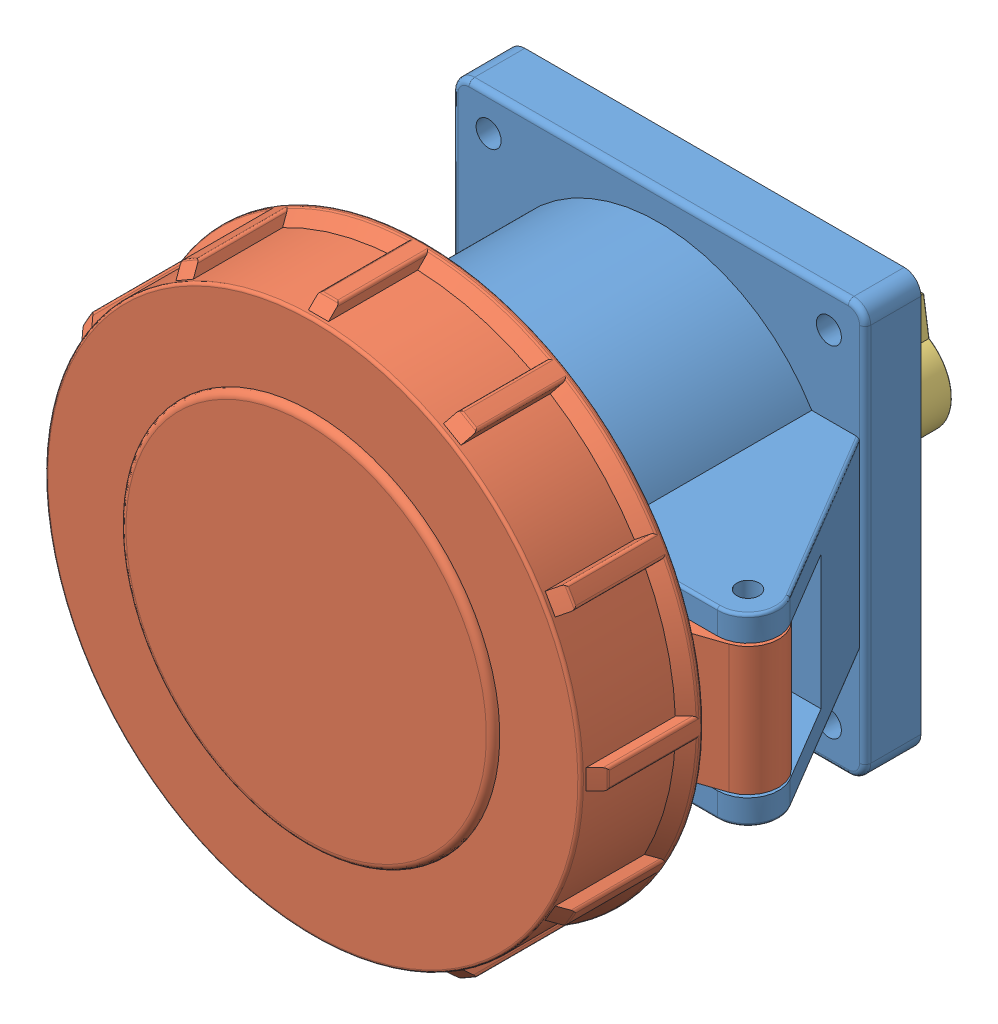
SolidWorks assembly Сборка 3242.SLDASM, configuration По умолчанию (file format 10000). Lengths in mm.
Overall size (105 100 94.21).
3 component instances, 3 part files, 5 mates.
Components (placement in the parent):
- Корпус 3242-1: Корпус 3242.SLDPRT [По умолчанию] at (-46.2638 17.0993 -1.1382) size (92.42 74 61.04)
- Крышка 3242,3252,4242,4252-1: Крышка 3242,3252,4242,4252.SLDPRT [По умолчанию] at (-46.2638 17.0993 70.8618) x (0 1 0) z (0 0 -1) size (100 105 35.2)
- Колодка 3242,4242-1: Колодка 3242,4242.SLDPRT [По умолчанию] at (-46.2638 17.0993 -13.1382) size (46 46 30.01)
Mates (geometry in assembly coordinates):
- Концентричный1: concentric aligned: cylinder of Корпус 3242-1 through (-46.2638 17.0993 59.8618) axis (0 0 -1) radius 32; cylinder of Крышка 3242,3252,4242,4252-1 through (-46.2638 17.0993 59.8618) axis (0 0 -1) radius 45
- Совпадение1: coincident anti-aligned: plane of Корпус 3242-1 through (-46.2638 17.0993 59.8618) normal (0 0 1); plane of Крышка 3242,3252,4242,4252-1 through (-46.2638 17.0993 59.8618) normal (0 0 -1)
- Параллельность1: parallel aligned: plane of Корпус 3242-1 through (-83.2638 -19.9007 8.8618) normal (0 -1 0); plane of Крышка 3242,3252,4242,4252-1 through (-4.7739 5.5993 48.7843) normal (0 -1 0)
- Концентричный2: concentric aligned: circle of Корпус 3242-1; circle of Колодка 3242,4242-1
- Совпадение2: coincident anti-aligned: plane of Корпус 3242-1 through (-46.2638 17.0993 7.8618) normal (0 0 -1); plane of Колодка 3242,4242-1 through (-46.2638 17.0993 7.8618) normal (0 0 1)
